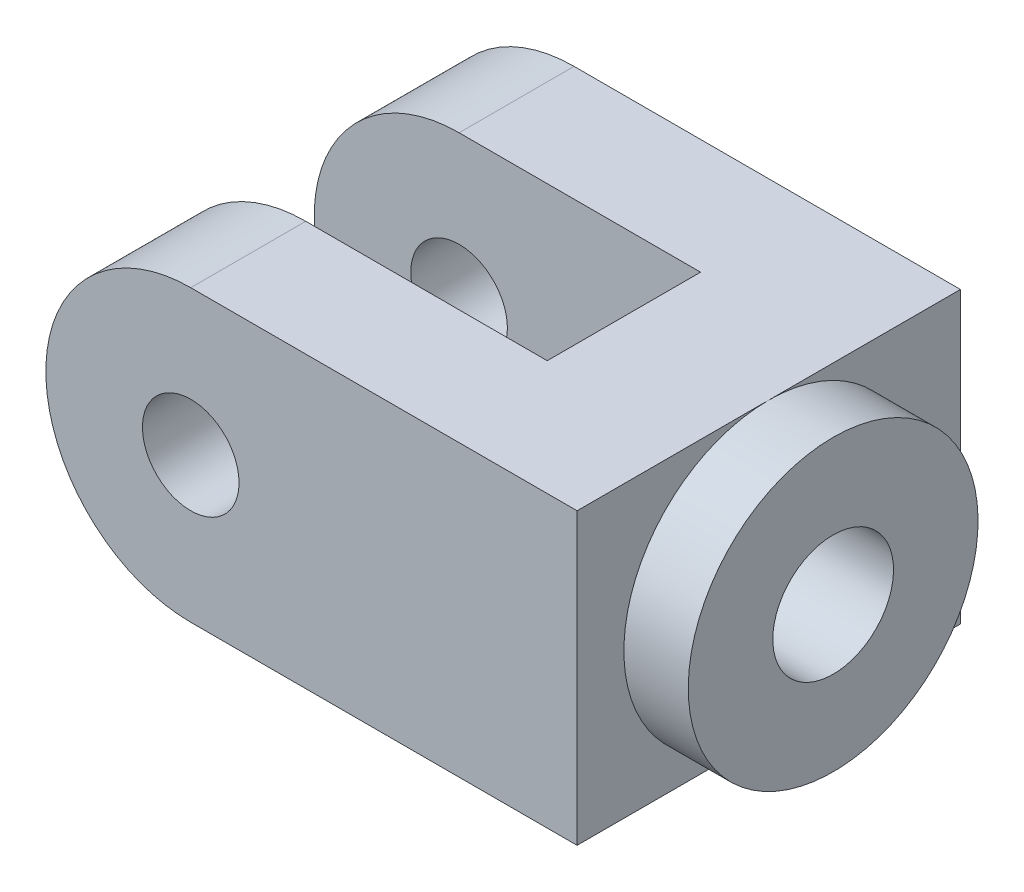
from build123d import *

# Parameters (mm, degrees)
SKETCH1_W               = 132
SKETCH1_H               = 72
BOSS_EXTRUDE1_DEPTH     = 47.625
CUT_EXTRUDE1_DEPTH      = 122.344808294
CUT_EXTRUDE1_DEPTH_BACK = 122.344808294
SKETCH3_W               = 96
SKETCH3_H               = 38.1
CUT_EXTRUDE2_DEPTH      = 109.665268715
SKETCH4_R               = 15
CUT_EXTRUDE3_DEPTH      = 145.872842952
BOSS_EXTRUDE2_START     = 16
SKETCH5_R               = 36
SKETCH5_R_2             = 15
BOSS_EXTRUDE2_DEPTH     = 16
SKETCH6_R               = 12
CUT_EXTRUDE4_DEPTH      = 131.738527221


with BuildPart() as part:
    # Sketch1 → Boss-Extrude1 (new, symmetric)
    with BuildSketch(Plane.XY):
        Rectangle(SKETCH1_W, SKETCH1_H)
    extrude(amount=BOSS_EXTRUDE1_DEPTH, both=True)

    # Sketch2 → Cut-Extrude1 (cut, two sides: drawn at the far end of the back side and taken through both)
    with BuildSketch(Plane.XY.offset(47.625).offset(-CUT_EXTRUDE1_DEPTH_BACK)):
        with BuildLine():
            Line((220.000002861, 36), (-30, 36))
            ThreePointArc((-30, 36), (-66, 8.94e-07), (-30.000001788, -36))
            Line((-30.000001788, -36), (220.000001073, -36.000012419))
            Line((220.000001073, -36.000012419), (-280.00000465, -36))
            Line((-280.00000465, -36), (-280.000002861, 36.000012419))
            Line((-280.000002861, 36.000012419), (220.000002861, 36))
        make_face()
    extrude(amount=CUT_EXTRUDE1_DEPTH + CUT_EXTRUDE1_DEPTH_BACK, mode=Mode.SUBTRACT)

    # Sketch3 → Cut-Extrude2 (cut, through all)
    with BuildSketch(Plane(origin=(0, 36, 0), x_dir=(1, 0, 0), z_dir=(0, 1, 0))):
        with Locations((-18, 0.005)):
            Rectangle(SKETCH3_W, SKETCH3_H)
    extrude(amount=-CUT_EXTRUDE2_DEPTH, mode=Mode.SUBTRACT)

    # Sketch4 → Cut-Extrude3 (cut, through all)
    with BuildSketch(Plane(origin=(66, 0, 0), x_dir=(0, 0, -1), z_dir=(1, 0, 0))):
        with Locations(Location((0, 0, 0), (0, 0, 90))):
            Circle(SKETCH4_R)
    extrude(amount=-CUT_EXTRUDE3_DEPTH, mode=Mode.SUBTRACT)

    # Sketch5 → Boss-Extrude2 (add)
    with BuildSketch(Plane(origin=(66, 0, 0), x_dir=(0, 0, -1), z_dir=(1, 0, 0)).offset(BOSS_EXTRUDE2_START)):
        with Locations(Location((0, 0, 0), (0, 0, 90))):
            Circle(SKETCH5_R)
        with Locations(Location((0, 0, 0), (0, 0, 90))):
            Circle(SKETCH5_R_2, mode=Mode.SUBTRACT)
    extrude(amount=-BOSS_EXTRUDE2_DEPTH)

    # Sketch6 → Cut-Extrude4 (cut, through all)
    with BuildSketch(Plane.XY.offset(47.625)):
        with Locations((-30, 0)):
            Circle(SKETCH6_R)
    extrude(amount=-CUT_EXTRUDE4_DEPTH, mode=Mode.SUBTRACT)


solid = part.part
